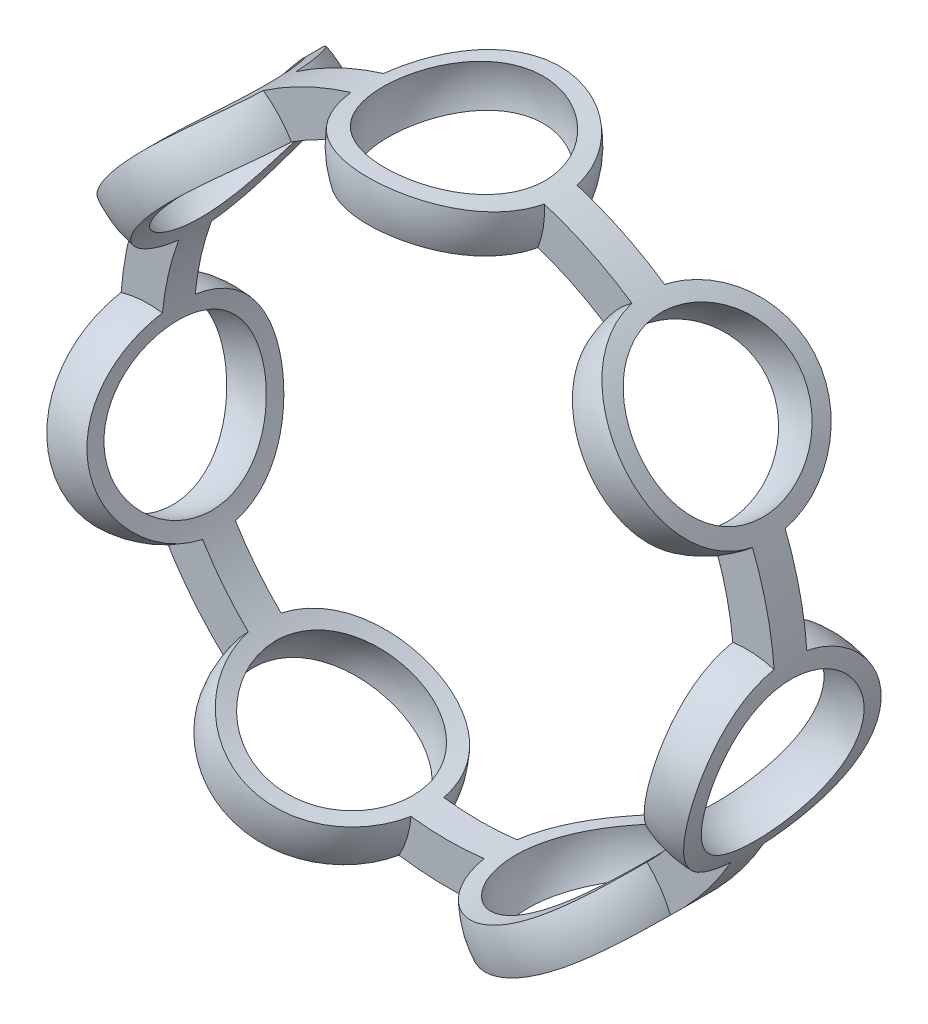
from build123d import *

# Parameters (mm, degrees)
ESQUISSE1_R                  = 8
ESQUISSE1_R_2                = 7
BASE_EXTRU_MINCE_DEPTH       = 0.4
R_P_TITION_CIRCULAIRE1_COUNT = 7
ESQUISSE4_OUTSIDE_W          = 26.95
ESQUISSE4_OUTSIDE_H          = 26.583
ESQUISSE4_OUTSIDE_R          = 8
ESQUISSE4_OUTSIDE_R_2        = 7
ENL_V_MAT_EXTRU_1_DEPTH      = 5


with BuildPart() as part:
    # Esquisse1 → Base-Extru.-Mince (new, symmetric)
    with BuildSketch(Plane.XY):
        Circle(ESQUISSE1_R)
        Circle(ESQUISSE1_R_2, mode=Mode.SUBTRACT)
    extrude(amount=BASE_EXTRU_MINCE_DEPTH, both=True)

    # Esquisse2 → Boss.-R_vol.1 (revolve)
    with BuildSketch(Plane.XY):
        with BuildLine():
            Line((0, 9.9), (0, 5.1))
            ThreePointArc((0, 5.1), (-2.4, 7.5), (0, 9.9))
        make_face()
    boss_r_vol_1 = revolve(axis=Axis((0, 1.057268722, 0), (0, 1, 0)))

    # Esquisse3 → Enl_vement de mati_re-R_volution2 (revolve, cut)
    with BuildSketch(Plane.XY):
        with BuildLine():
            Line((0, 5.5), (0, 9.5))
            ThreePointArc((0, 9.5), (-2, 7.5), (0, 5.5))
        make_face()
    enl_vement_de_mati_re_r_volution2 = revolve(axis=Axis((0, 12.291659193, 0), (0, -1, 0)), mode=Mode.SUBTRACT)

    # R_p_tition circulaire1: Boss.-R_vol.1, Enl_vement de mati_re-R_volution2 ×7 about axis
    r_p_tition_circulaire1_axis = Axis((0, 0, 0), (0, 0, 1))
    add([boss_r_vol_1.rotate(r_p_tition_circulaire1_axis, i * 360 / R_P_TITION_CIRCULAIRE1_COUNT) for i in range(1, R_P_TITION_CIRCULAIRE1_COUNT)])
    add([enl_vement_de_mati_re_r_volution2.rotate(r_p_tition_circulaire1_axis, i * 360 / R_P_TITION_CIRCULAIRE1_COUNT) for i in range(1, R_P_TITION_CIRCULAIRE1_COUNT)], mode=Mode.SUBTRACT)

    # Esquisse4 outside → Enl_v. mat.-Extru.1 (cut, symmetric)
    # profile 1 of 2: a face of its own
    with BuildSketch(Plane.XY):
        with Locations((0, 0.3715)):
            Rectangle(ESQUISSE4_OUTSIDE_W, ESQUISSE4_OUTSIDE_H)
        with Locations(Location((0, 0, 0), (0, 0, 158.60175355))):
            Circle(ESQUISSE4_OUTSIDE_R, mode=Mode.SUBTRACT)
    # profile 2 of 2: a face of its own
    with BuildSketch(Plane.XY):
        with Locations(Location((0, 0, 0), (0, 0, 159.797396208))):
            Circle(ESQUISSE4_OUTSIDE_R_2)
    extrude(amount=ENL_V_MAT_EXTRU_1_DEPTH, both=True, mode=Mode.SUBTRACT)


solid = part.part
